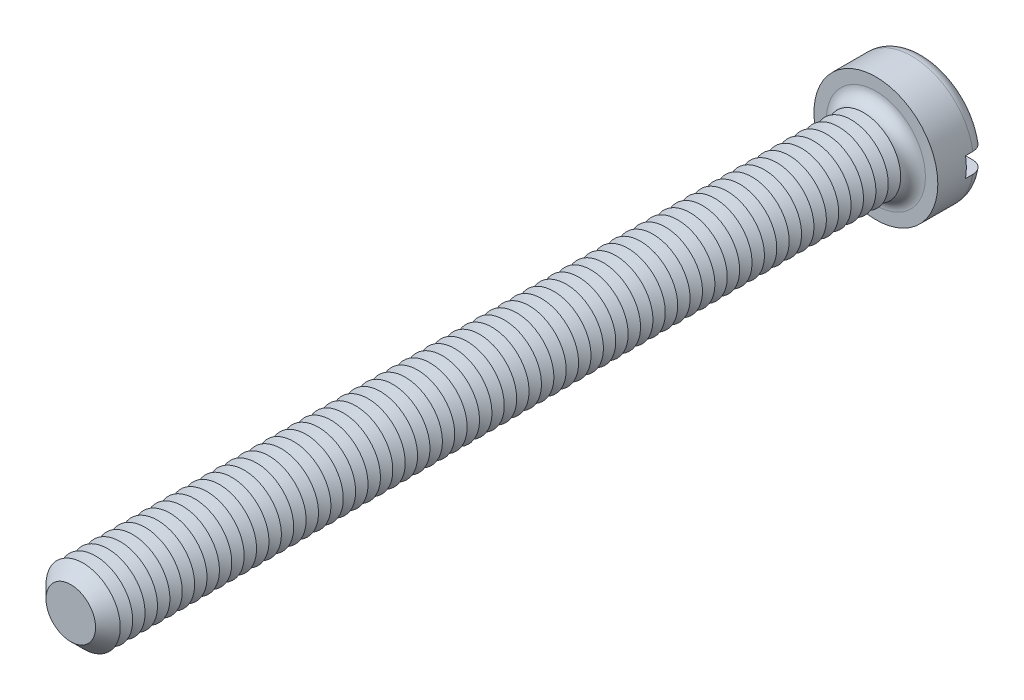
from build123d import *

# Parameters (mm, degrees)
SKETCH3_R           = 5
BOSS_EXTRUDE2_DEPTH = 3.9
SKETCH4_R           = 3
BOSS_EXTRUDE3_DEPTH = 65
FILLET1_R           = 1
CHAMFER1_SIZE       = 1
LPATTERN1_COUNT     = 63
LPATTERN1_PITCH     = 1
SKETCH8_W           = 10
SKETCH8_H           = 1.6
CUT_EXTRUDE1_DEPTH  = 1.6


with BuildPart() as part:
    # Sketch3 → Boss-Extrude2 (new body)
    with BuildSketch(Plane.XY):
        Circle(SKETCH3_R)
    extrude(amount=-BOSS_EXTRUDE2_DEPTH)

    # Sketch4 → Boss-Extrude3 (add)
    with BuildSketch(Plane.XY):
        Circle(SKETCH4_R)
    extrude(amount=BOSS_EXTRUDE3_DEPTH)

    # Fillet1
    fillet1_edges = [part.edges().sort_by_distance(p)[0] for p in [
        (-5, 0, -3.9),
        (-3, 0, 0),
    ]]
    fillet(fillet1_edges, radius=FILLET1_R)

    # Chamfer1
    chamfer1_edges = [part.edges().sort_by_distance(p)[0] for p in [
        (-3, 0, 65),
    ]]
    chamfer(chamfer1_edges, length=CHAMFER1_SIZE)

    # Sketch6 → Cut-Revolve1 (revolve, cut)
    with BuildSketch(Plane(origin=(0, 0, 0), x_dir=(0, 0, -1), z_dir=(1, 0, 0)), mode=Mode.PRIVATE) as cut_revolve1_sk:
        Polygon((-1, 3), (-1.5, 2.133974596), (-2, 3), align=None)
    cut_revolve1 = revolve(cut_revolve1_sk.sketch.rotate(Axis((0, 0, -1.694361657), (0, 0, 1)), 90), axis=Axis((0, 0, -1.694361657), (0, 0, 1)), mode=Mode.SUBTRACT)

    # LPattern1: Cut-Revolve1 ×63
    with Locations(*[(0, 0, i * LPATTERN1_PITCH) for i in range(1, LPATTERN1_COUNT)]):
        add(cut_revolve1, mode=Mode.SUBTRACT)

    # Sketch8 → Cut-Extrude1 (cut)
    with BuildSketch(Plane(origin=(0, 0, -3.9), x_dir=(-1, 0, 0), z_dir=(0, 0, -1))):
        Rectangle(SKETCH8_W, SKETCH8_H)
    extrude(amount=-CUT_EXTRUDE1_DEPTH, mode=Mode.SUBTRACT)


solid = part.part
